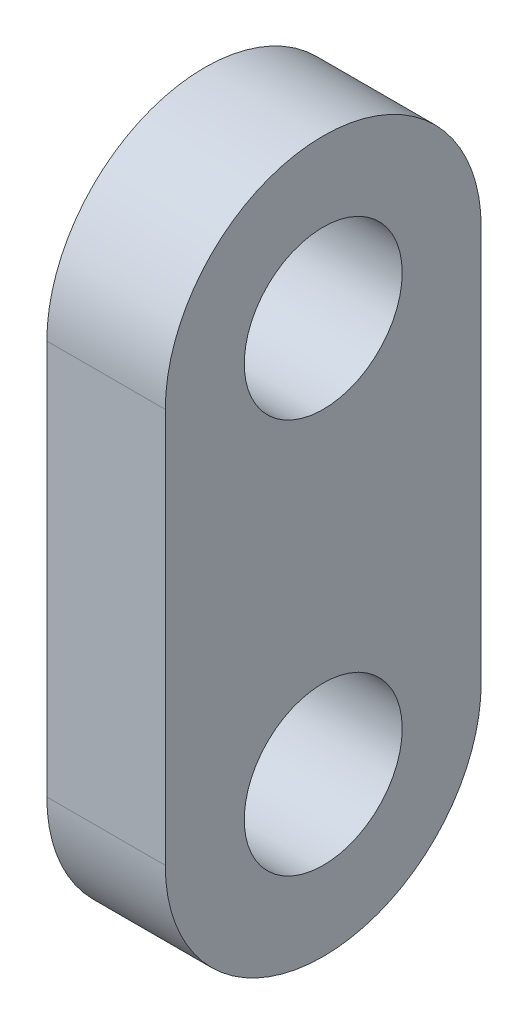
ISO-10303-21;
HEADER;
FILE_DESCRIPTION(('STEP AP214'),'2;1');
FILE_NAME('part.step','',(''),(''),'','','');
FILE_SCHEMA(('AUTOMOTIVE_DESIGN { 1 0 10303 214 1 1 1 1 }'));
ENDSEC;
DATA;
#1=APPLICATION_CONTEXT('core data for automotive mechanical design processes');
#2=APPLICATION_PROTOCOL_DEFINITION('international standard','automotive_design',2000,#1);
#3=PRODUCT_CONTEXT('',#1,'mechanical');
#4=PRODUCT('Part','Part','',(#3));
#5=PRODUCT_RELATED_PRODUCT_CATEGORY('part','',(#4));
#6=PRODUCT_DEFINITION_FORMATION('','',#4);
#7=PRODUCT_DEFINITION_CONTEXT('part definition',#1,'design');
#8=PRODUCT_DEFINITION('design','',#6,#7);
#9=PRODUCT_DEFINITION_SHAPE('','',#8);
#10=(LENGTH_UNIT() NAMED_UNIT(*) SI_UNIT(.MILLI.,.METRE.));
#11=(NAMED_UNIT(*) PLANE_ANGLE_UNIT() SI_UNIT($,.RADIAN.));
#12=(NAMED_UNIT(*) SI_UNIT($,.STERADIAN.) SOLID_ANGLE_UNIT());
#13=UNCERTAINTY_MEASURE_WITH_UNIT(LENGTH_MEASURE(1.E-05),#10,'distance_accuracy_value','');
#14=(GEOMETRIC_REPRESENTATION_CONTEXT(3) GLOBAL_UNCERTAINTY_ASSIGNED_CONTEXT((#13)) GLOBAL_UNIT_ASSIGNED_CONTEXT((#10,
#11,#12)) REPRESENTATION_CONTEXT('',''));
#15=CARTESIAN_POINT('',(0.,0.,0.));
#16=DIRECTION('',(0.,0.,1.));
#17=DIRECTION('',(1.,0.,0.));
#18=AXIS2_PLACEMENT_3D('',#15,#16,#17);
#19=CARTESIAN_POINT('',(3.,10.,0.));
#20=DIRECTION('',(1.,0.,0.));
#21=DIRECTION('',(0.,0.,-1.));
#22=AXIS2_PLACEMENT_3D('',#19,#20,#21);
#23=PLANE('',#22);
#24=CARTESIAN_POINT('',(3.,0.,0.));
#25=DIRECTION('',(1.,0.,0.));
#26=DIRECTION('',(0.,0.,-1.));
#27=AXIS2_PLACEMENT_3D('',#24,#25,#26);
#28=CIRCLE('',#27,2.);
#29=CARTESIAN_POINT('',(3.,0.,-2.));
#30=VERTEX_POINT('',#29);
#31=EDGE_CURVE('E99',#30,#30,#28,.T.);
#32=ORIENTED_EDGE('',*,*,#31,.F.);
#33=EDGE_LOOP('',(#32));
#34=FACE_BOUND('',#33,.T.);
#35=CARTESIAN_POINT('',(3.,10.,0.));
#36=DIRECTION('',(1.,0.,0.));
#37=DIRECTION('',(0.,0.,-1.));
#38=AXIS2_PLACEMENT_3D('',#35,#36,#37);
#39=CIRCLE('',#38,4.);
#40=CARTESIAN_POINT('',(3.,10.,-4.));
#41=VERTEX_POINT('',#40);
#42=CARTESIAN_POINT('',(3.,10.,4.));
#43=VERTEX_POINT('',#42);
#44=EDGE_CURVE('E84',#41,#43,#39,.T.);
#45=ORIENTED_EDGE('',*,*,#44,.T.);
#46=DIRECTION('',(0.,-1.,0.));
#47=VECTOR('',#46,1.);
#48=CARTESIAN_POINT('',(3.,10.,4.));
#49=LINE('',#48,#47);
#50=CARTESIAN_POINT('',(3.,0.,4.));
#51=VERTEX_POINT('',#50);
#52=EDGE_CURVE('E79',#43,#51,#49,.T.);
#53=ORIENTED_EDGE('',*,*,#52,.T.);
#54=CARTESIAN_POINT('',(3.,0.,0.));
#55=DIRECTION('',(1.,0.,0.));
#56=DIRECTION('',(0.,0.,1.));
#57=AXIS2_PLACEMENT_3D('',#54,#55,#56);
#58=CIRCLE('',#57,4.);
#59=CARTESIAN_POINT('',(3.,0.,-4.));
#60=VERTEX_POINT('',#59);
#61=EDGE_CURVE('E82',#51,#60,#58,.T.);
#62=ORIENTED_EDGE('',*,*,#61,.T.);
#63=DIRECTION('',(0.,1.,0.));
#64=VECTOR('',#63,1.);
#65=CARTESIAN_POINT('',(3.,10.,-4.));
#66=LINE('',#65,#64);
#67=EDGE_CURVE('E49',#60,#41,#66,.T.);
#68=ORIENTED_EDGE('',*,*,#67,.T.);
#69=EDGE_LOOP('',(#45,#53,#62,#68));
#70=FACE_BOUND('',#69,.T.);
#71=CARTESIAN_POINT('',(3.,10.,0.));
#72=DIRECTION('',(1.,0.,0.));
#73=DIRECTION('',(0.,0.,-1.));
#74=AXIS2_PLACEMENT_3D('',#71,#72,#73);
#75=CIRCLE('',#74,2.);
#76=CARTESIAN_POINT('',(3.,10.,-2.));
#77=VERTEX_POINT('',#76);
#78=EDGE_CURVE('E114',#77,#77,#75,.T.);
#79=ORIENTED_EDGE('',*,*,#78,.F.);
#80=EDGE_LOOP('',(#79));
#81=FACE_BOUND('',#80,.T.);
#82=ADVANCED_FACE('F32',(#34,#70,#81),#23,.T.);
#83=CARTESIAN_POINT('',(0.,10.,0.));
#84=DIRECTION('',(1.,0.,0.));
#85=DIRECTION('',(0.,0.,-1.));
#86=AXIS2_PLACEMENT_3D('',#83,#84,#85);
#87=PLANE('',#86);
#88=CARTESIAN_POINT('',(0.,0.,0.));
#89=DIRECTION('',(1.,0.,0.));
#90=DIRECTION('',(0.,0.,-1.));
#91=AXIS2_PLACEMENT_3D('',#88,#89,#90);
#92=CIRCLE('',#91,2.);
#93=CARTESIAN_POINT('',(0.,0.,-2.));
#94=VERTEX_POINT('',#93);
#95=EDGE_CURVE('E111',#94,#94,#92,.T.);
#96=ORIENTED_EDGE('',*,*,#95,.T.);
#97=EDGE_LOOP('',(#96));
#98=FACE_BOUND('',#97,.T.);
#99=CARTESIAN_POINT('',(0.,10.,0.));
#100=DIRECTION('',(1.,0.,0.));
#101=DIRECTION('',(0.,0.,-1.));
#102=AXIS2_PLACEMENT_3D('',#99,#100,#101);
#103=CIRCLE('',#102,4.);
#104=CARTESIAN_POINT('',(0.,10.,-4.));
#105=VERTEX_POINT('',#104);
#106=CARTESIAN_POINT('',(0.,10.,4.));
#107=VERTEX_POINT('',#106);
#108=EDGE_CURVE('E96',#105,#107,#103,.T.);
#109=ORIENTED_EDGE('',*,*,#108,.F.);
#110=DIRECTION('',(0.,1.,0.));
#111=VECTOR('',#110,1.);
#112=CARTESIAN_POINT('',(0.,10.,-4.));
#113=LINE('',#112,#111);
#114=CARTESIAN_POINT('',(0.,0.,-4.));
#115=VERTEX_POINT('',#114);
#116=EDGE_CURVE('E72',#115,#105,#113,.T.);
#117=ORIENTED_EDGE('',*,*,#116,.F.);
#118=CARTESIAN_POINT('',(0.,0.,0.));
#119=DIRECTION('',(1.,0.,0.));
#120=DIRECTION('',(0.,0.,1.));
#121=AXIS2_PLACEMENT_3D('',#118,#119,#120);
#122=CIRCLE('',#121,4.);
#123=CARTESIAN_POINT('',(0.,0.,4.));
#124=VERTEX_POINT('',#123);
#125=EDGE_CURVE('E66',#124,#115,#122,.T.);
#126=ORIENTED_EDGE('',*,*,#125,.F.);
#127=DIRECTION('',(0.,-1.,0.));
#128=VECTOR('',#127,1.);
#129=CARTESIAN_POINT('',(0.,10.,4.));
#130=LINE('',#129,#128);
#131=EDGE_CURVE('E88',#107,#124,#130,.T.);
#132=ORIENTED_EDGE('',*,*,#131,.F.);
#133=EDGE_LOOP('',(#109,#117,#126,#132));
#134=FACE_BOUND('',#133,.T.);
#135=CARTESIAN_POINT('',(0.,10.,0.));
#136=DIRECTION('',(1.,0.,0.));
#137=DIRECTION('',(0.,0.,-1.));
#138=AXIS2_PLACEMENT_3D('',#135,#136,#137);
#139=CIRCLE('',#138,2.);
#140=CARTESIAN_POINT('',(0.,10.,-2.));
#141=VERTEX_POINT('',#140);
#142=EDGE_CURVE('E117',#141,#141,#139,.T.);
#143=ORIENTED_EDGE('',*,*,#142,.T.);
#144=EDGE_LOOP('',(#143));
#145=FACE_BOUND('',#144,.T.);
#146=ADVANCED_FACE('F107',(#98,#134,#145),#87,.F.);
#147=CARTESIAN_POINT('',(3.,10.,0.));
#148=DIRECTION('',(-1.,0.,0.));
#149=DIRECTION('',(0.,0.,1.));
#150=AXIS2_PLACEMENT_3D('',#147,#148,#149);
#151=CYLINDRICAL_SURFACE('',#150,4.);
#152=ORIENTED_EDGE('',*,*,#108,.T.);
#153=DIRECTION('',(-1.,0.,0.));
#154=VECTOR('',#153,1.);
#155=CARTESIAN_POINT('',(3.,10.,4.));
#156=LINE('',#155,#154);
#157=EDGE_CURVE('E11',#43,#107,#156,.T.);
#158=ORIENTED_EDGE('',*,*,#157,.F.);
#159=ORIENTED_EDGE('',*,*,#44,.F.);
#160=DIRECTION('',(-1.,0.,0.));
#161=VECTOR('',#160,1.);
#162=CARTESIAN_POINT('',(3.,10.,-4.));
#163=LINE('',#162,#161);
#164=EDGE_CURVE('E92',#41,#105,#163,.T.);
#165=ORIENTED_EDGE('',*,*,#164,.T.);
#166=EDGE_LOOP('',(#152,#158,#159,#165));
#167=FACE_BOUND('',#166,.T.);
#168=ADVANCED_FACE('F34',(#167),#151,.T.);
#169=CARTESIAN_POINT('',(3.,10.,4.));
#170=DIRECTION('',(0.,0.,-1.));
#171=DIRECTION('',(0.,1.,0.));
#172=AXIS2_PLACEMENT_3D('',#169,#170,#171);
#173=PLANE('',#172);
#174=ORIENTED_EDGE('',*,*,#131,.T.);
#175=DIRECTION('',(-1.,0.,0.));
#176=VECTOR('',#175,1.);
#177=CARTESIAN_POINT('',(3.,0.,4.));
#178=LINE('',#177,#176);
#179=EDGE_CURVE('E41',#51,#124,#178,.T.);
#180=ORIENTED_EDGE('',*,*,#179,.F.);
#181=ORIENTED_EDGE('',*,*,#52,.F.);
#182=ORIENTED_EDGE('',*,*,#157,.T.);
#183=EDGE_LOOP('',(#174,#180,#181,#182));
#184=FACE_BOUND('',#183,.T.);
#185=ADVANCED_FACE('F87',(#184),#173,.F.);
#186=CARTESIAN_POINT('',(3.,0.,0.));
#187=DIRECTION('',(-1.,0.,0.));
#188=DIRECTION('',(0.,0.,1.));
#189=AXIS2_PLACEMENT_3D('',#186,#187,#188);
#190=CYLINDRICAL_SURFACE('',#189,4.);
#191=ORIENTED_EDGE('',*,*,#125,.T.);
#192=DIRECTION('',(-1.,0.,0.));
#193=VECTOR('',#192,1.);
#194=CARTESIAN_POINT('',(3.,0.,-4.));
#195=LINE('',#194,#193);
#196=EDGE_CURVE('E89',#60,#115,#195,.T.);
#197=ORIENTED_EDGE('',*,*,#196,.F.);
#198=ORIENTED_EDGE('',*,*,#61,.F.);
#199=ORIENTED_EDGE('',*,*,#179,.T.);
#200=EDGE_LOOP('',(#191,#197,#198,#199));
#201=FACE_BOUND('',#200,.T.);
#202=ADVANCED_FACE('F90',(#201),#190,.T.);
#203=CARTESIAN_POINT('',(3.,10.,-4.));
#204=DIRECTION('',(0.,0.,1.));
#205=DIRECTION('',(0.,-1.,0.));
#206=AXIS2_PLACEMENT_3D('',#203,#204,#205);
#207=PLANE('',#206);
#208=ORIENTED_EDGE('',*,*,#116,.T.);
#209=ORIENTED_EDGE('',*,*,#164,.F.);
#210=ORIENTED_EDGE('',*,*,#67,.F.);
#211=ORIENTED_EDGE('',*,*,#196,.T.);
#212=EDGE_LOOP('',(#208,#209,#210,#211));
#213=FACE_BOUND('',#212,.T.);
#214=ADVANCED_FACE('F104',(#213),#207,.F.);
#215=CARTESIAN_POINT('',(3.,0.,0.));
#216=DIRECTION('',(-1.,0.,0.));
#217=DIRECTION('',(0.,0.,1.));
#218=AXIS2_PLACEMENT_3D('',#215,#216,#217);
#219=CYLINDRICAL_SURFACE('',#218,2.);
#220=ORIENTED_EDGE('',*,*,#31,.T.);
#221=EDGE_LOOP('',(#220));
#222=FACE_BOUND('',#221,.T.);
#223=ORIENTED_EDGE('',*,*,#95,.F.);
#224=EDGE_LOOP('',(#223));
#225=FACE_BOUND('',#224,.T.);
#226=ADVANCED_FACE('F135',(#222,#225),#219,.F.);
#227=CARTESIAN_POINT('',(3.,10.,0.));
#228=DIRECTION('',(-1.,0.,0.));
#229=DIRECTION('',(0.,0.,1.));
#230=AXIS2_PLACEMENT_3D('',#227,#228,#229);
#231=CYLINDRICAL_SURFACE('',#230,2.);
#232=ORIENTED_EDGE('',*,*,#78,.T.);
#233=EDGE_LOOP('',(#232));
#234=FACE_BOUND('',#233,.T.);
#235=ORIENTED_EDGE('',*,*,#142,.F.);
#236=EDGE_LOOP('',(#235));
#237=FACE_BOUND('',#236,.T.);
#238=ADVANCED_FACE('F123',(#234,#237),#231,.F.);
#239=CLOSED_SHELL('',(#82,#146,#168,#185,#202,#214,#226,#238));
#240=MANIFOLD_SOLID_BREP('B2',#239);
#241=ADVANCED_BREP_SHAPE_REPRESENTATION('',(#18,#240),#14);
#242=SHAPE_DEFINITION_REPRESENTATION(#9,#241);
ENDSEC;
END-ISO-10303-21;
